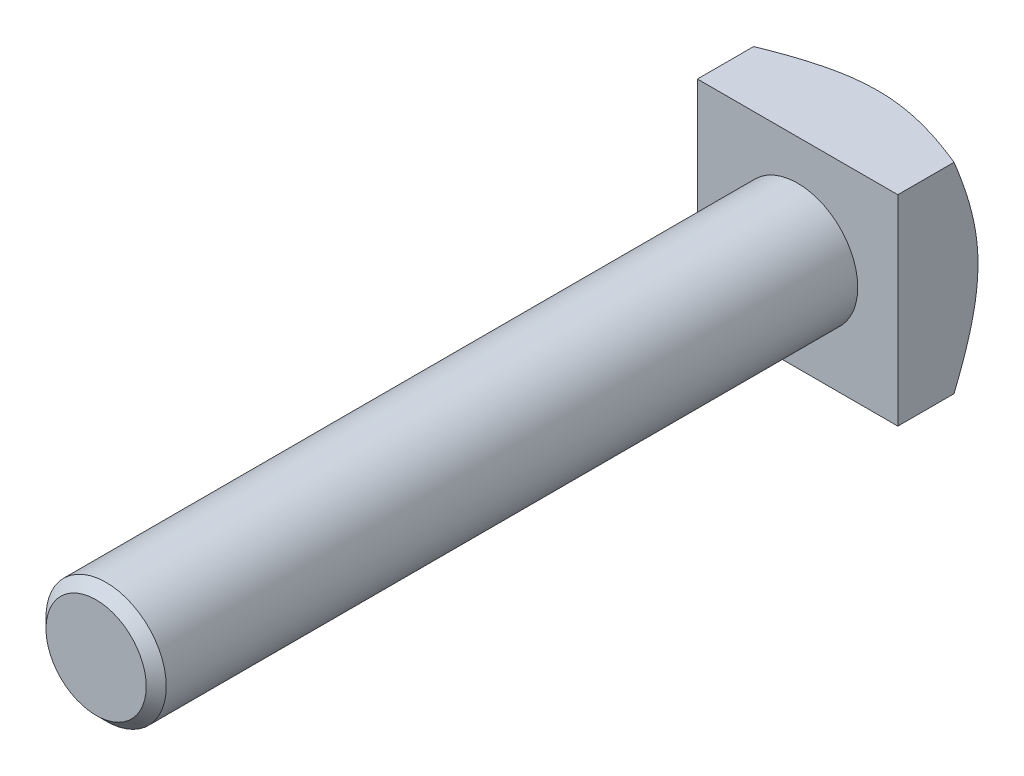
from build123d import *

# Parameters (mm, degrees)
ESQUISSE1_W          = 10
ESQUISSE1_H          = 10
BASE_EXTRUSION_DEPTH = 4
ESQUISSE4_R          = 3
BOSS_EXTRU_1_DEPTH   = 35
CHANFREIN1_SIZE      = 0.5


with BuildPart() as part:
    # Esquisse1 → Base-Extrusion (new body)
    with BuildSketch(Plane.XY):
        Rectangle(ESQUISSE1_W, ESQUISSE1_H)
    extrude(amount=-BASE_EXTRUSION_DEPTH)

    # Esquisse3 → Enl_vement de mati_re-R_volution1 (revolve, cut)
    with BuildSketch(Plane(origin=(0, 0, 0), x_dir=(-0.7071067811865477, -0.7071067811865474, 0), z_dir=(-0.7071067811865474, 0.7071067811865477, 0)), mode=Mode.PRIVATE) as enl_vement_de_mati_re_r_volution1_sk:
        Polygon((-5, -4), (-7.071067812, -4), (-7.071067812, -2.804268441), align=None)
    revolve(enl_vement_de_mati_re_r_volution1_sk.sketch.rotate(Axis((0, 0, -4), (0, 0, 1)), 315), axis=Axis((0, 0, -4), (0, 0, 1)), mode=Mode.SUBTRACT)

    # Esquisse4 → Boss.-Extru.1 (add)
    with BuildSketch(Plane.XY):
        Circle(ESQUISSE4_R)
    extrude(amount=BOSS_EXTRU_1_DEPTH)

    # Chanfrein1
    chanfrein1_edges = [part.edges().sort_by_distance(p)[0] for p in [
        (-3, 0, 35),
    ]]
    chamfer(chanfrein1_edges, length=CHANFREIN1_SIZE)


solid = part.part
